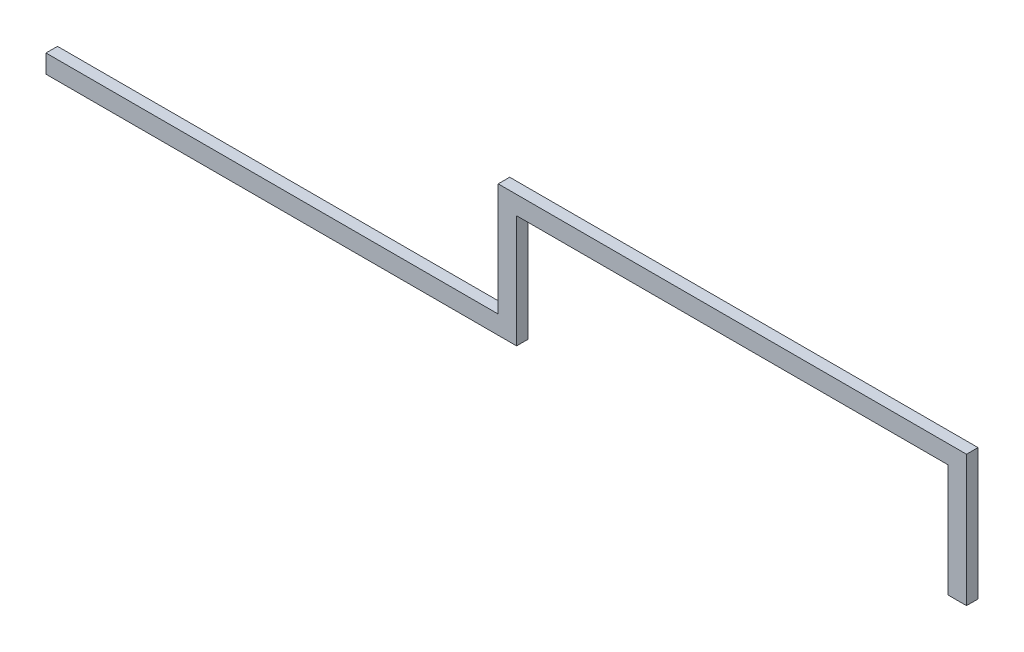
ISO-10303-21;
HEADER;
FILE_DESCRIPTION(('STEP AP214'),'2;1');
FILE_NAME('part.step','',(''),(''),'','','');
FILE_SCHEMA(('AUTOMOTIVE_DESIGN { 1 0 10303 214 1 1 1 1 }'));
ENDSEC;
DATA;
#1=APPLICATION_CONTEXT('core data for automotive mechanical design processes');
#2=APPLICATION_PROTOCOL_DEFINITION('international standard','automotive_design',2000,#1);
#3=PRODUCT_CONTEXT('',#1,'mechanical');
#4=PRODUCT('Part','Part','',(#3));
#5=PRODUCT_RELATED_PRODUCT_CATEGORY('part','',(#4));
#6=PRODUCT_DEFINITION_FORMATION('','',#4);
#7=PRODUCT_DEFINITION_CONTEXT('part definition',#1,'design');
#8=PRODUCT_DEFINITION('design','',#6,#7);
#9=PRODUCT_DEFINITION_SHAPE('','',#8);
#10=(LENGTH_UNIT() NAMED_UNIT(*) SI_UNIT(.MILLI.,.METRE.));
#11=(NAMED_UNIT(*) PLANE_ANGLE_UNIT() SI_UNIT($,.RADIAN.));
#12=(NAMED_UNIT(*) SI_UNIT($,.STERADIAN.) SOLID_ANGLE_UNIT());
#13=UNCERTAINTY_MEASURE_WITH_UNIT(LENGTH_MEASURE(1.E-05),#10,'distance_accuracy_value','');
#14=(GEOMETRIC_REPRESENTATION_CONTEXT(3) GLOBAL_UNCERTAINTY_ASSIGNED_CONTEXT((#13)) GLOBAL_UNIT_ASSIGNED_CONTEXT((#10,
#11,#12)) REPRESENTATION_CONTEXT('',''));
#15=CARTESIAN_POINT('',(0.,0.,0.));
#16=DIRECTION('',(0.,0.,1.));
#17=DIRECTION('',(1.,0.,0.));
#18=AXIS2_PLACEMENT_3D('',#15,#16,#17);
#19=CARTESIAN_POINT('',(-200.,0.,5.));
#20=DIRECTION('',(0.,1.,0.));
#21=DIRECTION('',(0.,0.,1.));
#22=AXIS2_PLACEMENT_3D('',#19,#20,#21);
#23=PLANE('',#22);
#24=DIRECTION('',(1.,0.,0.));
#25=VECTOR('',#24,1.);
#26=CARTESIAN_POINT('',(-200.,0.,5.));
#27=LINE('',#26,#25);
#28=CARTESIAN_POINT('',(192.,0.,5.));
#29=VERTEX_POINT('',#28);
#30=CARTESIAN_POINT('',(200.,0.,5.));
#31=VERTEX_POINT('',#30);
#32=EDGE_CURVE('E166',#29,#31,#27,.T.);
#33=ORIENTED_EDGE('',*,*,#32,.F.);
#34=DIRECTION('',(0.,0.,1.));
#35=VECTOR('',#34,1.);
#36=CARTESIAN_POINT('',(192.,0.,0.));
#37=LINE('',#36,#35);
#38=CARTESIAN_POINT('',(192.,0.,0.));
#39=VERTEX_POINT('',#38);
#40=EDGE_CURVE('E141',#39,#29,#37,.T.);
#41=ORIENTED_EDGE('',*,*,#40,.F.);
#42=DIRECTION('',(1.,0.,0.));
#43=VECTOR('',#42,1.);
#44=CARTESIAN_POINT('',(-200.,0.,0.));
#45=LINE('',#44,#43);
#46=CARTESIAN_POINT('',(200.,0.,0.));
#47=VERTEX_POINT('',#46);
#48=EDGE_CURVE('E132',#39,#47,#45,.T.);
#49=ORIENTED_EDGE('',*,*,#48,.T.);
#50=DIRECTION('',(0.,0.,-1.));
#51=VECTOR('',#50,1.);
#52=CARTESIAN_POINT('',(200.,0.,5.));
#53=LINE('',#52,#51);
#54=EDGE_CURVE('E43',#31,#47,#53,.T.);
#55=ORIENTED_EDGE('',*,*,#54,.F.);
#56=EDGE_LOOP('',(#33,#41,#49,#55));
#57=FACE_BOUND('',#56,.T.);
#58=ADVANCED_FACE('F35',(#57),#23,.F.);
#59=CARTESIAN_POINT('',(-200.,57.,5.));
#60=DIRECTION('',(1.,0.,0.));
#61=DIRECTION('',(0.,0.,-1.));
#62=AXIS2_PLACEMENT_3D('',#59,#60,#61);
#63=PLANE('',#62);
#64=DIRECTION('',(0.,-1.,0.));
#65=VECTOR('',#64,1.);
#66=CARTESIAN_POINT('',(-200.,57.,5.));
#67=LINE('',#66,#65);
#68=CARTESIAN_POINT('',(-200.,8.,5.));
#69=VERTEX_POINT('',#68);
#70=CARTESIAN_POINT('',(-200.,0.,5.));
#71=VERTEX_POINT('',#70);
#72=EDGE_CURVE('E164',#69,#71,#67,.T.);
#73=ORIENTED_EDGE('',*,*,#72,.F.);
#74=DIRECTION('',(0.,0.,1.));
#75=VECTOR('',#74,1.);
#76=CARTESIAN_POINT('',(-200.,8.,0.));
#77=LINE('',#76,#75);
#78=CARTESIAN_POINT('',(-200.,8.,0.));
#79=VERTEX_POINT('',#78);
#80=EDGE_CURVE('E153',#79,#69,#77,.T.);
#81=ORIENTED_EDGE('',*,*,#80,.F.);
#82=DIRECTION('',(0.,-1.,0.));
#83=VECTOR('',#82,1.);
#84=CARTESIAN_POINT('',(-200.,57.,0.));
#85=LINE('',#84,#83);
#86=CARTESIAN_POINT('',(-200.,0.,0.));
#87=VERTEX_POINT('',#86);
#88=EDGE_CURVE('E160',#79,#87,#85,.T.);
#89=ORIENTED_EDGE('',*,*,#88,.T.);
#90=DIRECTION('',(0.,0.,-1.));
#91=VECTOR('',#90,1.);
#92=CARTESIAN_POINT('',(-200.,0.,5.));
#93=LINE('',#92,#91);
#94=EDGE_CURVE('E11',#71,#87,#93,.T.);
#95=ORIENTED_EDGE('',*,*,#94,.F.);
#96=EDGE_LOOP('',(#73,#81,#89,#95));
#97=FACE_BOUND('',#96,.T.);
#98=ADVANCED_FACE('F37',(#97),#63,.F.);
#99=CARTESIAN_POINT('',(4.49576076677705,0.,0.));
#100=VERTEX_POINT('',#99);
#101=EDGE_CURVE('E178',#87,#100,#45,.T.);
#102=ORIENTED_EDGE('',*,*,#101,.T.);
#103=DIRECTION('',(0.,0.,1.));
#104=VECTOR('',#103,1.);
#105=CARTESIAN_POINT('',(4.49576076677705,0.,0.));
#106=LINE('',#105,#104);
#107=CARTESIAN_POINT('',(4.49576076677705,0.,5.));
#108=VERTEX_POINT('',#107);
#109=EDGE_CURVE('E144',#100,#108,#106,.T.);
#110=ORIENTED_EDGE('',*,*,#109,.T.);
#111=EDGE_CURVE('E168',#71,#108,#27,.T.);
#112=ORIENTED_EDGE('',*,*,#111,.F.);
#113=ORIENTED_EDGE('',*,*,#94,.T.);
#114=EDGE_LOOP('',(#102,#110,#112,#113));
#115=FACE_BOUND('',#114,.T.);
#116=ADVANCED_FACE('F203',(#115),#23,.F.);
#117=CARTESIAN_POINT('',(200.,57.,5.));
#118=DIRECTION('',(-1.,0.,0.));
#119=DIRECTION('',(0.,0.,1.));
#120=AXIS2_PLACEMENT_3D('',#117,#118,#119);
#121=PLANE('',#120);
#122=DIRECTION('',(0.,1.,0.));
#123=VECTOR('',#122,1.);
#124=CARTESIAN_POINT('',(200.,57.,0.));
#125=LINE('',#124,#123);
#126=CARTESIAN_POINT('',(200.,57.,0.));
#127=VERTEX_POINT('',#126);
#128=EDGE_CURVE('E181',#47,#127,#125,.T.);
#129=ORIENTED_EDGE('',*,*,#128,.T.);
#130=DIRECTION('',(0.,0.,-1.));
#131=VECTOR('',#130,1.);
#132=CARTESIAN_POINT('',(200.,57.,5.));
#133=LINE('',#132,#131);
#134=CARTESIAN_POINT('',(200.,57.,5.));
#135=VERTEX_POINT('',#134);
#136=EDGE_CURVE('E176',#135,#127,#133,.T.);
#137=ORIENTED_EDGE('',*,*,#136,.F.);
#138=DIRECTION('',(0.,1.,0.));
#139=VECTOR('',#138,1.);
#140=CARTESIAN_POINT('',(200.,57.,5.));
#141=LINE('',#140,#139);
#142=EDGE_CURVE('E171',#31,#135,#141,.T.);
#143=ORIENTED_EDGE('',*,*,#142,.F.);
#144=ORIENTED_EDGE('',*,*,#54,.T.);
#145=EDGE_LOOP('',(#129,#137,#143,#144));
#146=FACE_BOUND('',#145,.T.);
#147=ADVANCED_FACE('F190',(#146),#121,.F.);
#148=CARTESIAN_POINT('',(-200.,57.,5.));
#149=DIRECTION('',(0.,-1.,0.));
#150=DIRECTION('',(1.,0.,0.));
#151=AXIS2_PLACEMENT_3D('',#148,#149,#150);
#152=PLANE('',#151);
#153=DIRECTION('',(-1.,0.,0.));
#154=VECTOR('',#153,1.);
#155=CARTESIAN_POINT('',(-200.,57.,0.));
#156=LINE('',#155,#154);
#157=CARTESIAN_POINT('',(-3.50423923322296,57.,0.));
#158=VERTEX_POINT('',#157);
#159=EDGE_CURVE('E167',#127,#158,#156,.T.);
#160=ORIENTED_EDGE('',*,*,#159,.T.);
#161=DIRECTION('',(0.,0.,1.));
#162=VECTOR('',#161,1.);
#163=CARTESIAN_POINT('',(-3.50423923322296,57.,0.));
#164=LINE('',#163,#162);
#165=CARTESIAN_POINT('',(-3.50423923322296,57.,5.));
#166=VERTEX_POINT('',#165);
#167=EDGE_CURVE('E157',#158,#166,#164,.T.);
#168=ORIENTED_EDGE('',*,*,#167,.T.);
#169=DIRECTION('',(-1.,0.,0.));
#170=VECTOR('',#169,1.);
#171=CARTESIAN_POINT('',(-200.,57.,5.));
#172=LINE('',#171,#170);
#173=EDGE_CURVE('E173',#135,#166,#172,.T.);
#174=ORIENTED_EDGE('',*,*,#173,.F.);
#175=ORIENTED_EDGE('',*,*,#136,.T.);
#176=EDGE_LOOP('',(#160,#168,#174,#175));
#177=FACE_BOUND('',#176,.T.);
#178=ADVANCED_FACE('F196',(#177),#152,.F.);
#179=CARTESIAN_POINT('',(-200.,0.,5.));
#180=DIRECTION('',(0.,0.,1.));
#181=DIRECTION('',(1.,0.,0.));
#182=AXIS2_PLACEMENT_3D('',#179,#180,#181);
#183=PLANE('',#182);
#184=DIRECTION('',(0.,1.,0.));
#185=VECTOR('',#184,1.);
#186=CARTESIAN_POINT('',(192.,0.,5.));
#187=LINE('',#186,#185);
#188=CARTESIAN_POINT('',(192.,49.,5.));
#189=VERTEX_POINT('',#188);
#190=EDGE_CURVE('E118',#29,#189,#187,.T.);
#191=ORIENTED_EDGE('',*,*,#190,.F.);
#192=ORIENTED_EDGE('',*,*,#32,.T.);
#193=ORIENTED_EDGE('',*,*,#142,.T.);
#194=ORIENTED_EDGE('',*,*,#173,.T.);
#195=DIRECTION('',(0.,1.,0.));
#196=VECTOR('',#195,1.);
#197=CARTESIAN_POINT('',(-3.50423923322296,57.,5.));
#198=LINE('',#197,#196);
#199=CARTESIAN_POINT('',(-3.50423923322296,8.,5.));
#200=VERTEX_POINT('',#199);
#201=EDGE_CURVE('E151',#200,#166,#198,.T.);
#202=ORIENTED_EDGE('',*,*,#201,.F.);
#203=DIRECTION('',(1.,0.,0.));
#204=VECTOR('',#203,1.);
#205=CARTESIAN_POINT('',(-200.,8.,5.));
#206=LINE('',#205,#204);
#207=EDGE_CURVE('E143',#69,#200,#206,.T.);
#208=ORIENTED_EDGE('',*,*,#207,.F.);
#209=ORIENTED_EDGE('',*,*,#72,.T.);
#210=ORIENTED_EDGE('',*,*,#111,.T.);
#211=DIRECTION('',(0.,-1.,0.));
#212=VECTOR('',#211,1.);
#213=CARTESIAN_POINT('',(4.49576076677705,0.,5.));
#214=LINE('',#213,#212);
#215=CARTESIAN_POINT('',(4.49576076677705,49.,5.));
#216=VERTEX_POINT('',#215);
#217=EDGE_CURVE('E133',#216,#108,#214,.T.);
#218=ORIENTED_EDGE('',*,*,#217,.F.);
#219=DIRECTION('',(-1.,0.,0.));
#220=VECTOR('',#219,1.);
#221=CARTESIAN_POINT('',(192.,49.,5.));
#222=LINE('',#221,#220);
#223=EDGE_CURVE('E135',#189,#216,#222,.T.);
#224=ORIENTED_EDGE('',*,*,#223,.F.);
#225=EDGE_LOOP('',(#191,#192,#193,#194,#202,#208,#209,#210,#218,#224));
#226=FACE_BOUND('',#225,.T.);
#227=ADVANCED_FACE('F200',(#226),#183,.T.);
#228=CARTESIAN_POINT('',(-200.,0.,0.));
#229=DIRECTION('',(0.,0.,1.));
#230=DIRECTION('',(1.,0.,0.));
#231=AXIS2_PLACEMENT_3D('',#228,#229,#230);
#232=PLANE('',#231);
#233=ORIENTED_EDGE('',*,*,#48,.F.);
#234=DIRECTION('',(0.,1.,0.));
#235=VECTOR('',#234,1.);
#236=CARTESIAN_POINT('',(192.,0.,0.));
#237=LINE('',#236,#235);
#238=CARTESIAN_POINT('',(192.,49.,0.));
#239=VERTEX_POINT('',#238);
#240=EDGE_CURVE('E115',#39,#239,#237,.T.);
#241=ORIENTED_EDGE('',*,*,#240,.T.);
#242=DIRECTION('',(-1.,0.,0.));
#243=VECTOR('',#242,1.);
#244=CARTESIAN_POINT('',(192.,49.,0.));
#245=LINE('',#244,#243);
#246=CARTESIAN_POINT('',(4.49576076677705,49.,0.));
#247=VERTEX_POINT('',#246);
#248=EDGE_CURVE('E125',#239,#247,#245,.T.);
#249=ORIENTED_EDGE('',*,*,#248,.T.);
#250=DIRECTION('',(0.,-1.,0.));
#251=VECTOR('',#250,1.);
#252=CARTESIAN_POINT('',(4.49576076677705,0.,0.));
#253=LINE('',#252,#251);
#254=EDGE_CURVE('E50',#247,#100,#253,.T.);
#255=ORIENTED_EDGE('',*,*,#254,.T.);
#256=ORIENTED_EDGE('',*,*,#101,.F.);
#257=ORIENTED_EDGE('',*,*,#88,.F.);
#258=DIRECTION('',(1.,0.,0.));
#259=VECTOR('',#258,1.);
#260=CARTESIAN_POINT('',(-200.,8.,0.));
#261=LINE('',#260,#259);
#262=CARTESIAN_POINT('',(-3.50423923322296,8.,0.));
#263=VERTEX_POINT('',#262);
#264=EDGE_CURVE('E148',#79,#263,#261,.T.);
#265=ORIENTED_EDGE('',*,*,#264,.T.);
#266=DIRECTION('',(0.,1.,0.));
#267=VECTOR('',#266,1.);
#268=CARTESIAN_POINT('',(-3.50423923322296,57.,0.));
#269=LINE('',#268,#267);
#270=EDGE_CURVE('E58',#263,#158,#269,.T.);
#271=ORIENTED_EDGE('',*,*,#270,.T.);
#272=ORIENTED_EDGE('',*,*,#159,.F.);
#273=ORIENTED_EDGE('',*,*,#128,.F.);
#274=EDGE_LOOP('',(#233,#241,#249,#255,#256,#257,#265,#271,#272,#273));
#275=FACE_BOUND('',#274,.T.);
#276=ADVANCED_FACE('F130',(#275),#232,.F.);
#277=CARTESIAN_POINT('',(-3.50423923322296,57.,0.));
#278=DIRECTION('',(1.,0.,0.));
#279=DIRECTION('',(0.,0.,-1.));
#280=AXIS2_PLACEMENT_3D('',#277,#278,#279);
#281=PLANE('',#280);
#282=ORIENTED_EDGE('',*,*,#201,.T.);
#283=ORIENTED_EDGE('',*,*,#167,.F.);
#284=ORIENTED_EDGE('',*,*,#270,.F.);
#285=DIRECTION('',(0.,0.,1.));
#286=VECTOR('',#285,1.);
#287=CARTESIAN_POINT('',(-3.50423923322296,8.,0.));
#288=LINE('',#287,#286);
#289=EDGE_CURVE('E161',#263,#200,#288,.T.);
#290=ORIENTED_EDGE('',*,*,#289,.T.);
#291=EDGE_LOOP('',(#282,#283,#284,#290));
#292=FACE_BOUND('',#291,.T.);
#293=ADVANCED_FACE('F233',(#292),#281,.F.);
#294=CARTESIAN_POINT('',(-200.,8.,0.));
#295=DIRECTION('',(0.,-1.,0.));
#296=DIRECTION('',(0.,0.,-1.));
#297=AXIS2_PLACEMENT_3D('',#294,#295,#296);
#298=PLANE('',#297);
#299=ORIENTED_EDGE('',*,*,#207,.T.);
#300=ORIENTED_EDGE('',*,*,#289,.F.);
#301=ORIENTED_EDGE('',*,*,#264,.F.);
#302=ORIENTED_EDGE('',*,*,#80,.T.);
#303=EDGE_LOOP('',(#299,#300,#301,#302));
#304=FACE_BOUND('',#303,.T.);
#305=ADVANCED_FACE('F221',(#304),#298,.F.);
#306=CARTESIAN_POINT('',(192.,0.,0.));
#307=DIRECTION('',(1.,0.,0.));
#308=DIRECTION('',(0.,0.,-1.));
#309=AXIS2_PLACEMENT_3D('',#306,#307,#308);
#310=PLANE('',#309);
#311=ORIENTED_EDGE('',*,*,#190,.T.);
#312=DIRECTION('',(0.,0.,1.));
#313=VECTOR('',#312,1.);
#314=CARTESIAN_POINT('',(192.,49.,0.));
#315=LINE('',#314,#313);
#316=EDGE_CURVE('E111',#239,#189,#315,.T.);
#317=ORIENTED_EDGE('',*,*,#316,.F.);
#318=ORIENTED_EDGE('',*,*,#240,.F.);
#319=ORIENTED_EDGE('',*,*,#40,.T.);
#320=EDGE_LOOP('',(#311,#317,#318,#319));
#321=FACE_BOUND('',#320,.T.);
#322=ADVANCED_FACE('F113',(#321),#310,.F.);
#323=CARTESIAN_POINT('',(4.49576076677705,0.,0.));
#324=DIRECTION('',(-1.,0.,0.));
#325=DIRECTION('',(0.,0.,1.));
#326=AXIS2_PLACEMENT_3D('',#323,#324,#325);
#327=PLANE('',#326);
#328=ORIENTED_EDGE('',*,*,#217,.T.);
#329=ORIENTED_EDGE('',*,*,#109,.F.);
#330=ORIENTED_EDGE('',*,*,#254,.F.);
#331=DIRECTION('',(0.,0.,1.));
#332=VECTOR('',#331,1.);
#333=CARTESIAN_POINT('',(4.49576076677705,49.,0.));
#334=LINE('',#333,#332);
#335=EDGE_CURVE('E122',#247,#216,#334,.T.);
#336=ORIENTED_EDGE('',*,*,#335,.T.);
#337=EDGE_LOOP('',(#328,#329,#330,#336));
#338=FACE_BOUND('',#337,.T.);
#339=ADVANCED_FACE('F223',(#338),#327,.F.);
#340=CARTESIAN_POINT('',(192.,49.,0.));
#341=DIRECTION('',(0.,1.,0.));
#342=DIRECTION('',(-1.,0.,0.));
#343=AXIS2_PLACEMENT_3D('',#340,#341,#342);
#344=PLANE('',#343);
#345=ORIENTED_EDGE('',*,*,#223,.T.);
#346=ORIENTED_EDGE('',*,*,#335,.F.);
#347=ORIENTED_EDGE('',*,*,#248,.F.);
#348=ORIENTED_EDGE('',*,*,#316,.T.);
#349=EDGE_LOOP('',(#345,#346,#347,#348));
#350=FACE_BOUND('',#349,.T.);
#351=ADVANCED_FACE('F126',(#350),#344,.F.);
#352=CLOSED_SHELL('',(#58,#98,#116,#147,#178,#227,#276,#293,#305,#322,#339,#351));
#353=MANIFOLD_SOLID_BREP('B2',#352);
#354=ADVANCED_BREP_SHAPE_REPRESENTATION('',(#18,#353),#14);
#355=SHAPE_DEFINITION_REPRESENTATION(#9,#354);
ENDSEC;
END-ISO-10303-21;
